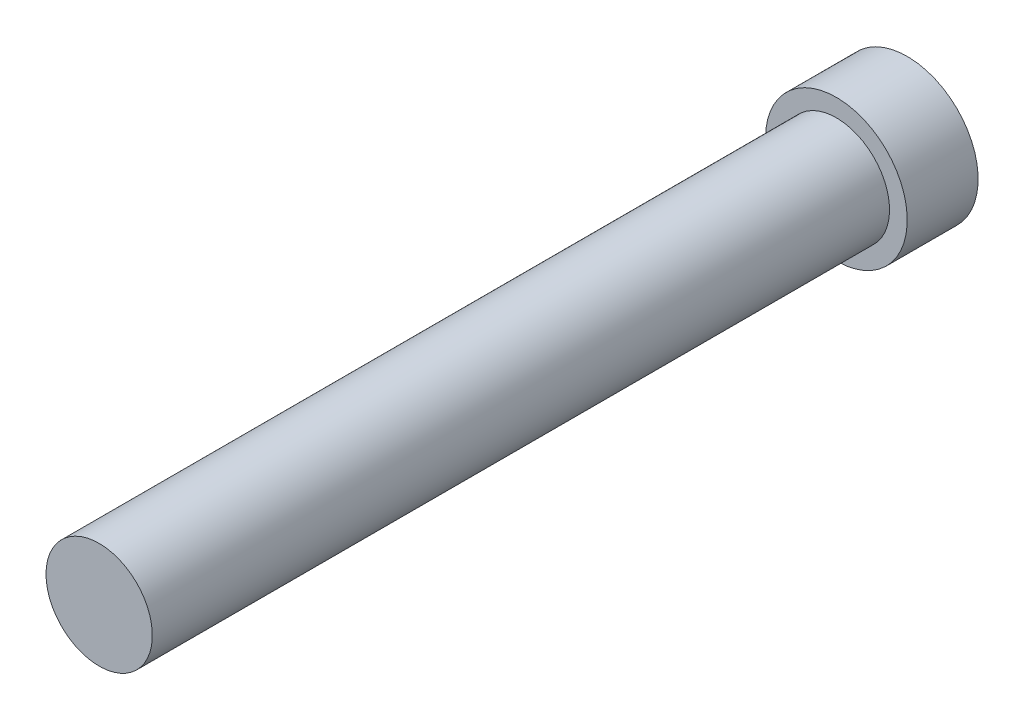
from build123d import *


with BuildPart() as part:
    # Logo3_bib1 → Revolve1 (revolve)
    with BuildSketch(Plane(origin=(0, 0, 0), x_dir=(-1, 0, 0), z_dir=(0, -1, 0))):
        Polygon((2.38125, 0), (3.175, 0), (3.175, 3.175), (0, 3.175), (0, -33.02), (2.38125, -33.02), align=None)
    revolve(axis=Axis((0, 0, -16.546754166), (0, 0, 1)))


solid = part.part
